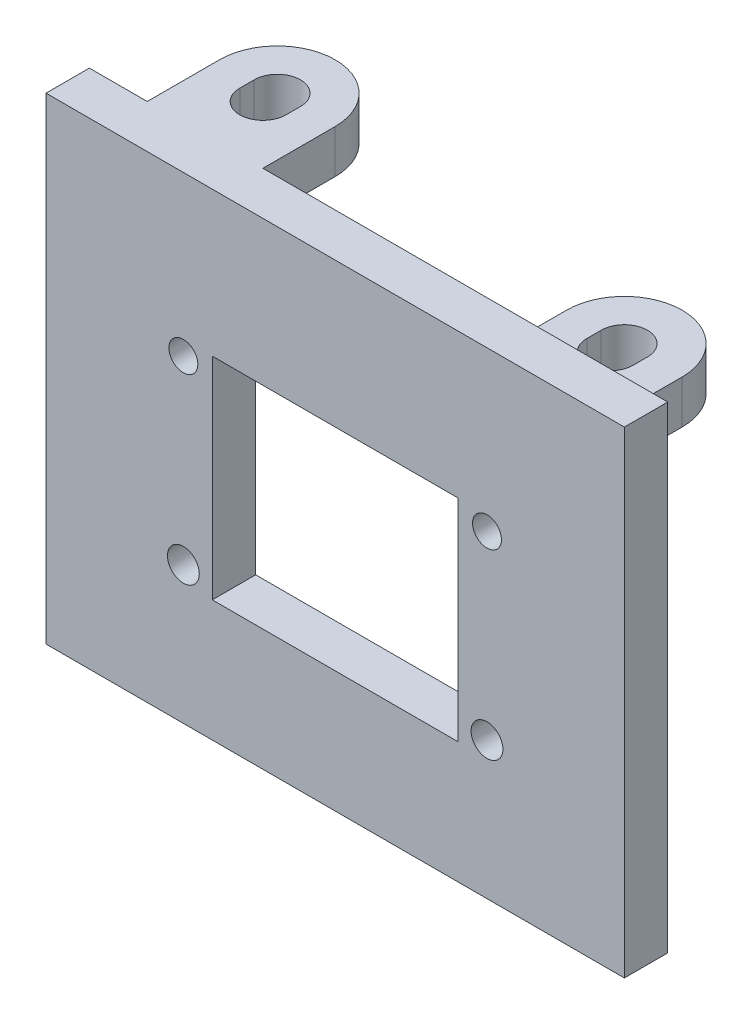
from build123d import *

# Parameters (mm, degrees)
SKETCH1_W           = 60
SKETCH1_H           = 3
BOSS_EXTRUDE1_DEPTH = 3
SKETCH1_3_W         = 60
SKETCH1_3_H         = 3
BOSS_EXTRUDE2_DEPTH = 3
SKETCH1_4_W         = 60
SKETCH1_4_H         = 3
BOSS_EXTRUDE3_DEPTH = 30
SKETCH2_W           = 10
SKETCH2_H           = 33
SKETCH2_R           = 1
SKETCH2_R_2         = 1.1
SKETCH2_W_2         = 8.5
SKETCH2_H_2         = 14.6
CUT_EXTRUDE1_DEPTH  = 45.09081537


with BuildPart() as part:
    # Sketch1 → Boss-Extrude1 (new body)
    # profile 1 of 2: a face of its own
    with BuildSketch(Plane(origin=(0, 0, 0), x_dir=(1, 0, 0), z_dir=(0, 1, 0))):
        with Locations((0, -1.5)):
            Rectangle(SKETCH1_W, SKETCH1_H)
    # profile 2 of 2: a face of its own
    with BuildSketch(Plane(origin=(0, 0, 0), x_dir=(1, 0, 0), z_dir=(0, 1, 0))):
        with BuildLine():
            Line((-16, 5), (-16, 0))
            Line((-16, 0), (-8, 0))
            Line((-8, 0), (-8, 5))
            ThreePointArc((-8, 5), (-12, 9), (-16, 5))
        make_face()
        with BuildLine():
            Line((-13.6, 4), (-13.6, 5))
            ThreePointArc((-13.6, 5), (-12, 6.6), (-10.4, 5))
            Line((-10.4, 5), (-10.4, 4))
            ThreePointArc((-10.4, 4), (-12, 2.4), (-13.6, 4))
        make_face(mode=Mode.SUBTRACT)
    extrude(amount=BOSS_EXTRUDE1_DEPTH)

    # Sketch1_3 → Boss-Extrude2 (add)
    # profile 1 of 2: a face of its own
    with BuildSketch(Plane(origin=(0, 0, 0), x_dir=(1, 0, 0), z_dir=(0, 1, 0))):
        with BuildLine():
            Line((8, 5), (8, 0))
            Line((8, 0), (16, 0))
            Line((16, 0), (16, 5))
            ThreePointArc((16, 5), (12, 9), (8, 5))
        make_face()
        with BuildLine():
            ThreePointArc((10.4, 5), (12, 6.6), (13.6, 5))
            Line((13.6, 5), (13.6, 4))
            ThreePointArc((13.6, 4), (12, 2.4), (10.4, 4))
            Line((10.4, 4), (10.4, 5))
        make_face(mode=Mode.SUBTRACT)
    # profile 2 of 2: a face of its own
    with BuildSketch(Plane(origin=(0, 0, 0), x_dir=(1, 0, 0), z_dir=(0, 1, 0))):
        with Locations((0, -1.5)):
            Rectangle(SKETCH1_3_W, SKETCH1_3_H)
    extrude(amount=-BOSS_EXTRUDE2_DEPTH)

    # Sketch1_4 → Boss-Extrude3 (add)
    with BuildSketch(Plane(origin=(0, 0, 0), x_dir=(1, 0, 0), z_dir=(0, 1, 0))):
        with Locations((0, -1.5)):
            Rectangle(SKETCH1_4_W, SKETCH1_4_H)
    extrude(amount=-BOSS_EXTRUDE3_DEPTH)

    # Sketch2 → Cut-Extrude1 (cut, through all)
    with BuildSketch(Plane.XY.offset(3)):
        with Locations((-25, -13.5)):
            Rectangle(SKETCH2_W, SKETCH2_H)
        with Locations((25, -13.5)):
            Rectangle(SKETCH2_W, SKETCH2_H)
        with Locations((-10.5, -8)):
            Circle(SKETCH2_R)
        with Locations((-10.5, -20.5)):
            Circle(SKETCH2_R_2)
        with Locations((10.5, -8)):
            Circle(SKETCH2_R)
        with Locations((10.5, -20.5)):
            Circle(SKETCH2_R_2)
        with Locations((-4.25, -14.3)):
            Rectangle(SKETCH2_W_2, SKETCH2_H_2)
        with Locations((4.25, -14.3)):
            Rectangle(SKETCH2_W_2, SKETCH2_H_2)
    extrude(amount=-CUT_EXTRUDE1_DEPTH, mode=Mode.SUBTRACT)


solid = part.part
